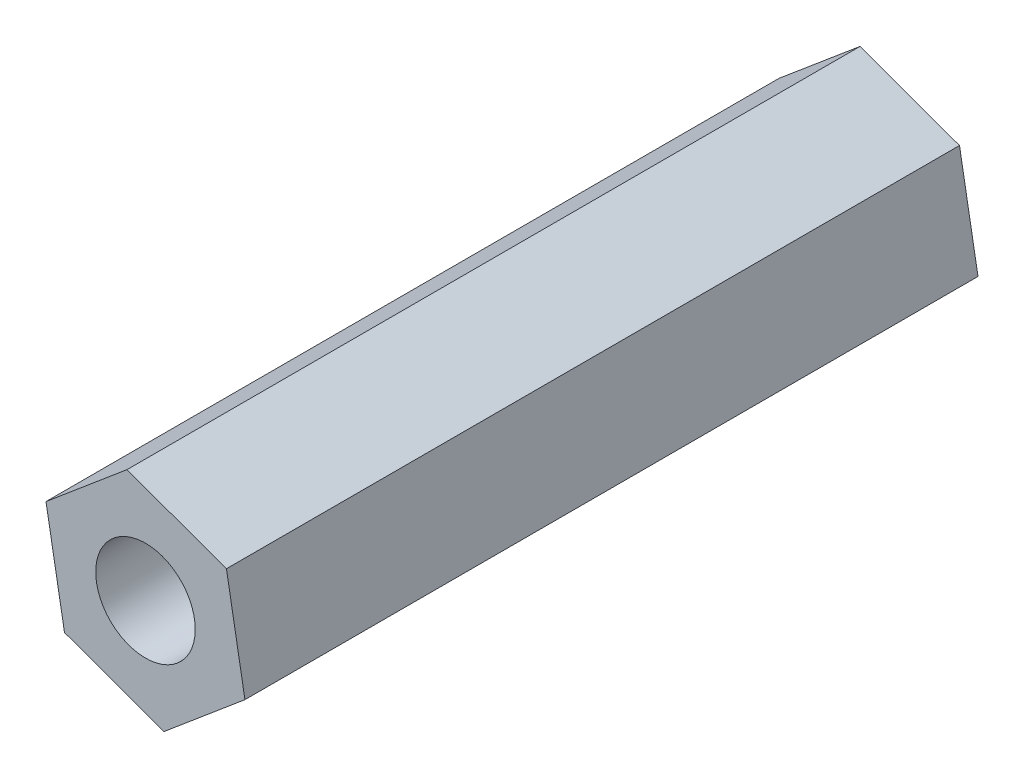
from build123d import *

# Parameters (mm, degrees)
BOSS_EXTRUDE1_DEPTH = 25.4
SKETCH2_R           = 1.72421427
CUT_EXTRUDE1_DEPTH  = 26.885683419


with BuildPart() as part:
    # Sketch1 → Boss-Extrude1 (new body)
    with BuildSketch(Plane.XY):
        Polygon((3.44648221, -1.250037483), (2.805805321, 2.359722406), (-0.640676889, 3.609759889), (-3.44648221, 1.250037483), (-2.805805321, -2.359722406), (0.640676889, -3.609759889), align=None)
    extrude(amount=BOSS_EXTRUDE1_DEPTH)

    # Sketch2 → Cut-Extrude1 (cut, through all)
    with BuildSketch(Plane.XY.offset(25.4)):
        Circle(SKETCH2_R)
    extrude(amount=-CUT_EXTRUDE1_DEPTH, mode=Mode.SUBTRACT)


solid = part.part
